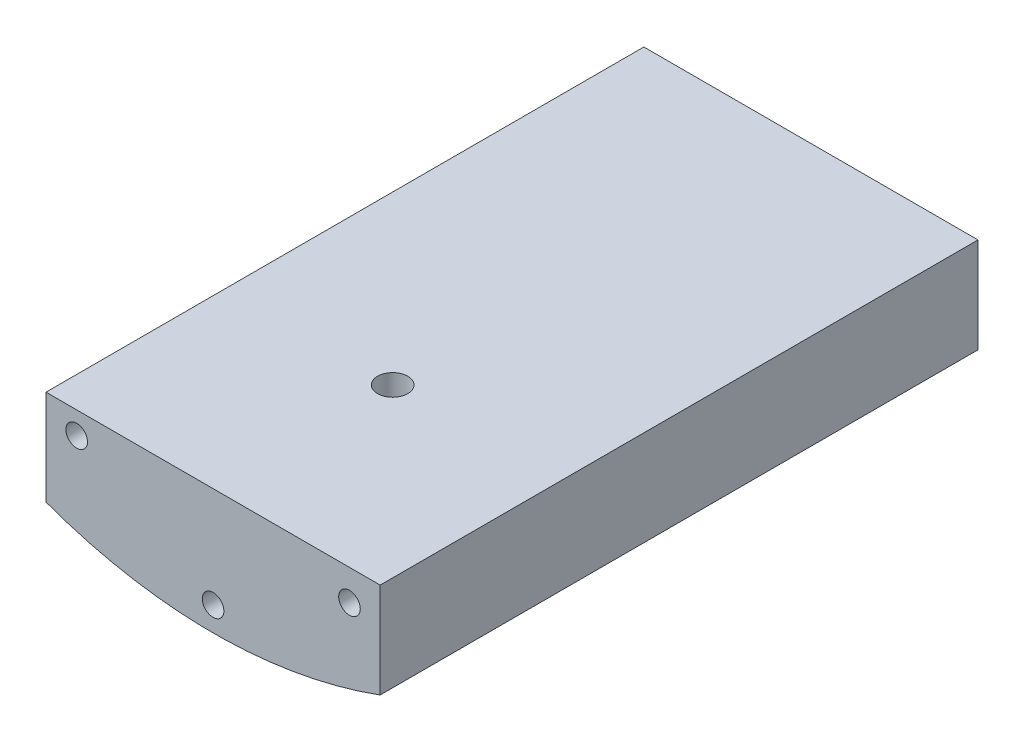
from build123d import *

# Parameters (mm, degrees)
BOSS_EXTRUDE1_DEPTH                               = 133.604
CBORE_FOR_1_4_PAN_HEAD_MACHINE_SCREW1_D           = 6.7564
CBORE_FOR_1_4_PAN_HEAD_MACHINE_SCREW1_CBORE_D     = 13.49248
CBORE_FOR_1_4_PAN_HEAD_MACHINE_SCREW1_CBORE_DEPTH = 4.445
F_10_32_TAPPED_HOLE1_D                            = 4.826


with BuildPart() as part:
    # Sketch1 → Boss-Extrude1 (new body)
    with BuildSketch(Plane.XY):
        with BuildLine():
            Line((-37.338, 0), (37.338, 0))
            Line((37.338, 0), (37.338, -21.277098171))
            ThreePointArc((37.338, -21.277098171), (0, -27.94), (-37.338, -21.277098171))
            Line((-37.338, -21.277098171), (-37.338, 0))
        make_face()
    extrude(amount=BOSS_EXTRUDE1_DEPTH)

    # CBORE for 1_4 Pan Head Machine Screw1 (through all)
    with Locations(Plane(origin=(0, -27.94, 93.472), x_dir=(-1, 0, 0), z_dir=(0, -1, 0))):
        with Locations((0, 0)):
            CounterBoreHole(CBORE_FOR_1_4_PAN_HEAD_MACHINE_SCREW1_D / 2, CBORE_FOR_1_4_PAN_HEAD_MACHINE_SCREW1_CBORE_D / 2, CBORE_FOR_1_4_PAN_HEAD_MACHINE_SCREW1_CBORE_DEPTH)

    # 10-32 Tapped Hole1 (through all)
    with Locations(Plane.XY.offset(133.604)):
        with Locations((30.48, -6.858), (-30.48, -5.000391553), (0, -22.5044)):
            Hole(F_10_32_TAPPED_HOLE1_D / 2)


solid = part.part
